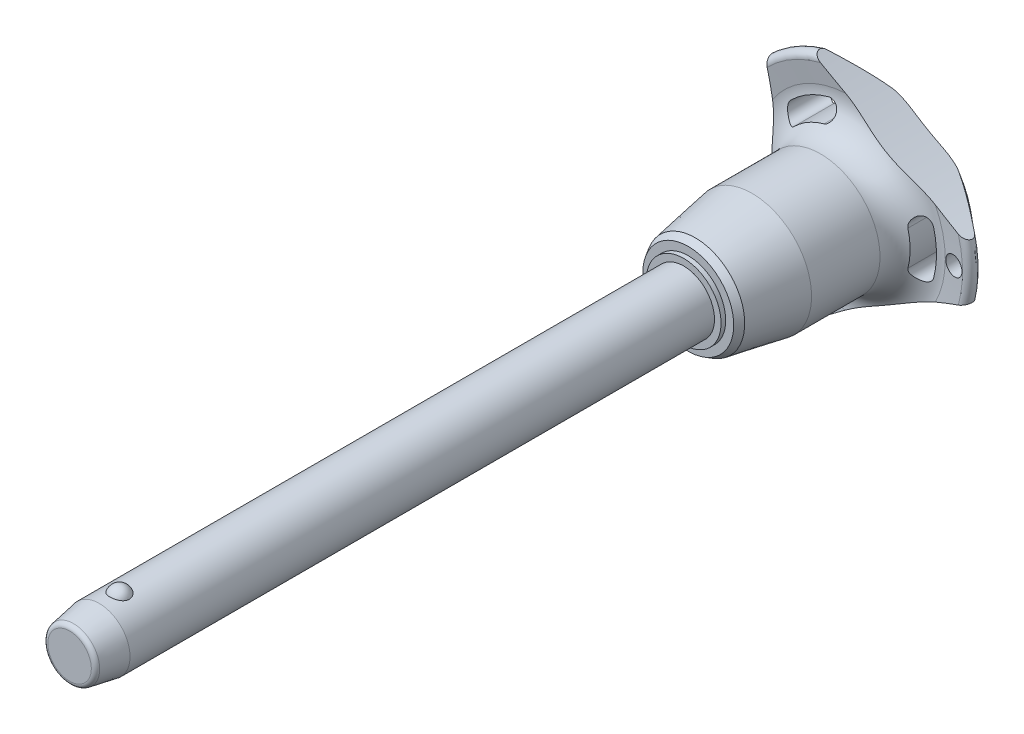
from build123d import *

# Parameters (mm, degrees)
SKETCH1_R           = 5
BOSS_EXTRUDE1_DEPTH = 90
SKETCH2_R           = 4.25
BOSS_EXTRUDE2_DEPTH = 33.3
BOSS_EXTRUDE3_START = 9.6
SKETCH1_2_R         = 5
BOSS_EXTRUDE3_DEPTH = 9.6
CHAMFER1_SIZE       = 4.8
CHAMFER1_SIZE2      = 0.846369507
FILLET1_R           = 0.75
SKETCH6_R           = 102.8
CUT_EXTRUDE1_DEPTH  = 127.380768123
CIRPATTERN1_COUNT   = 3
SKETCH7_R           = 1.5
CUT_EXTRUDE2_DEPTH  = 127.252726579


with BuildPart() as part:
    # Sketch1 → Boss-Extrude1 (new body)
    with BuildSketch(Plane.XY):
        Circle(SKETCH1_R)
    extrude(amount=-BOSS_EXTRUDE1_DEPTH)

    # Sketch2 → Boss-Extrude2 (add)
    with BuildSketch(Plane(origin=(0, 0, -90), x_dir=(-1, 0, 0), z_dir=(0, 0, -1))):
        Circle(SKETCH2_R)
    extrude(amount=BOSS_EXTRUDE2_DEPTH)

    # Sketch3 → Revolve1 (revolve)
    with BuildSketch(Plane(origin=(0, 0, 0), x_dir=(0, 0, -1), z_dir=(1, 0, 0))):
        with BuildLine():
            Line((-1.516575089, 6), (-1.516575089, 2.7))
            ThreePointArc((-1.516575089, 2.7), (0.133424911, 4.35), (-1.516575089, 6))
        make_face()
        with BuildLine():
            Line((-1.516575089, -2.7), (-1.516575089, -6))
            ThreePointArc((-1.516575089, -6), (0.133424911, -4.35), (-1.516575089, -2.7))
        make_face()
    revolve(axis=Axis((0, -2.7, 1.516575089), (0, 1, 0)))

    # Sketch1_2 → Boss-Extrude3 (add)
    with BuildSketch(Plane.XY.offset(BOSS_EXTRUDE3_START)):
        Circle(SKETCH1_2_R)
    extrude(amount=-BOSS_EXTRUDE3_DEPTH)

    # Chamfer1
    chamfer1_edges = [part.edges().sort_by_distance(p)[0] for p in [
        (-5, 0, 9.6),
    ]]
    chamfer1_side = [part.faces().sort_by_distance(p)[0] for p in [
        (-5, 0, -40.2),
    ]]
    chamfer(chamfer1_edges, length=CHAMFER1_SIZE, length2=CHAMFER1_SIZE2, reference=chamfer1_side[0])

    # Fillet1
    fillet1_edges = [part.edges().sort_by_distance(p)[0] for p in [
        (-4.153630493, 0, 9.6),
        (4.25, 0, -123.3),
    ]]
    fillet(fillet1_edges, radius=FILLET1_R)

    # Sketch4 → Revolve2 (revolve)
    with BuildSketch(Plane(origin=(0, 0, 0), x_dir=(0, 0, -1), z_dir=(1, 0, 0)), mode=Mode.PRIVATE) as revolve2_sk:
        Polygon((90, 0), (90, 6.067402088), (90.75, 6.067402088), (90.75, 7.371950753), (91.879772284, 8.024225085), (101.1, 9.65), (112.2, 9.65), (112.2, 0), align=None)
    revolve(revolve2_sk.sketch.rotate(Axis((0, 0, -112.2), (0, 0, 1)), 90), axis=Axis((0, 0, -112.2), (0, 0, 1)))

    # Sketch5 → Revolve3 (revolve)
    with BuildSketch(Plane(origin=(0, 0, 0), x_dir=(0, 0, -1), z_dir=(1, 0, 0)), mode=Mode.PRIVATE) as revolve3_sk:
        with BuildLine():
            Line((117.16082631, 15.274661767), (116.757834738, 18.475067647))
            ThreePointArc((116.757834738, 18.475067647), (117.349836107, 19.516443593), (118.516044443, 19.24278761))
            Line((118.516044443, 19.24278761), (122.835691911, 14.094832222))
            ThreePointArc((122.835691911, 14.094832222), (123.3, 12.689260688), (122.67067517, 11.349423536))
            ThreePointArc((122.67067517, 11.349423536), (119.033110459, 6.185112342), (117.75, 0))
            Line((117.75, 0), (112.2, 0))
            Line((112.2, 0), (112.2, 9.65))
            ThreePointArc((112.2, 9.65), (115.949887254, 11.342683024), (117.16082631, 15.274661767))
        make_face()
    revolve(revolve3_sk.sketch.rotate(Axis((0, 0, -117.75), (0, 0, 1)), 90), axis=Axis((0, 0, -117.75), (0, 0, 1)))

    # Sketch6 → Cut-Extrude1 (cut, through all)
    with BuildSketch(Plane.XY):
        with Locations((-115.2, 0)):
            Circle(SKETCH6_R)
        with BuildLine():
            ThreePointArc((13.411913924, -3.529271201), (13.868496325, 0), (13.411913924, 3.529271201))
            ThreePointArc((13.411913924, 3.529271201), (11.694200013, 4.531299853), (10.692171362, 2.813585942))
            ThreePointArc((10.692171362, 2.813585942), (11.056165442, 0), (10.692171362, -2.813585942))
            ThreePointArc((10.692171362, -2.813585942), (11.694200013, -4.531299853), (13.411913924, -3.529271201))
        make_face()
    cut_extrude1 = extrude(amount=-CUT_EXTRUDE1_DEPTH, mode=Mode.SUBTRACT)

    # CirPattern1: Cut-Extrude1 ×3 about axis
    cirpattern1_axis = Axis((0, 0, 0), (0, 0, 1))
    for i in range(1, CIRPATTERN1_COUNT):
        add(cut_extrude1.rotate(cirpattern1_axis, i * 360 / CIRPATTERN1_COUNT), mode=Mode.SUBTRACT)

    # Sketch7 → Cut-Extrude2 (cut, through all)
    with BuildSketch(Plane.XY):
        with Locations(Location((16.868496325, 0, 0), (0, 0, 225.467095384))):
            Circle(SKETCH7_R)
    extrude(amount=-CUT_EXTRUDE2_DEPTH, mode=Mode.SUBTRACT)


solid = part.part
